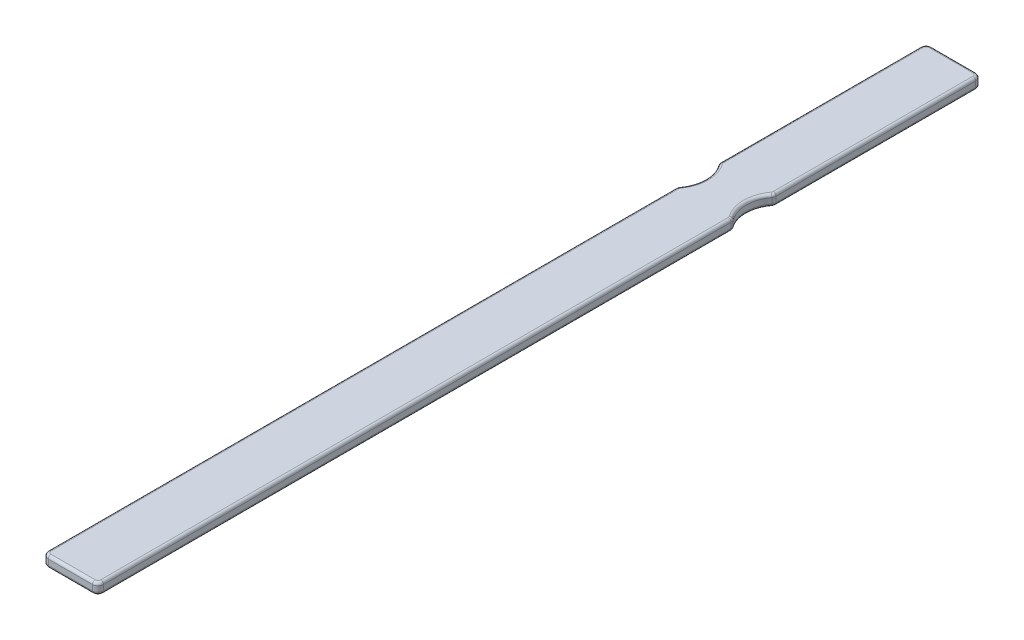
from build123d import *

# Parameters (mm, degrees)
BOSS_EXTRUDE1_DEPTH = 4
FILLET1_R           = 2
FILLET2_R           = 1


with BuildPart() as part:
    # Sketch1 → Boss-Extrude1 (new body)
    with BuildSketch(Plane(origin=(0, 0, 0), x_dir=(1, 0, 0), z_dir=(0, 1, 0))):
        with BuildLine():
            Line((-10, 0), (10, 0))
            Line((10, 0), (10, 230))
            ThreePointArc((10, 230), (7.367496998, 237.5), (10, 245))
            Line((10, 245), (10, 320))
            Line((10, 320), (-10, 320))
            Line((-10, 320), (-10, 245))
            ThreePointArc((-10, 245), (-7.367496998, 237.5), (-10, 230))
            Line((-10, 230), (-10, 0))
        make_face()
    extrude(amount=BOSS_EXTRUDE1_DEPTH)

    # Fillet1
    fillet1_edges = [part.edges().sort_by_distance(p)[0] for p in [
        (-10, 2, -230),
        (-10, 2, -245),
        (-10, 2, -320),
        (10, 2, -320),
        (10, 2, -245),
        (10, 2, -230),
        (10, 2, 0),
        (-10, 2, 0),
    ]]
    fillet(fillet1_edges, radius=FILLET1_R)

    # Fillet2
    fillet2_edges = [part.edges().sort_by_distance(p)[0] for p in [
        (10, 0, -281.835951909),
        (10, 4, -281.835951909),
        (-10, 0, -115.664048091),
        (-7.367496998, 0, -237.5),
        (-10, 0, -281.835951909),
        (0, 0, -320),
        (7.367496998, 0, -237.5),
        (10, 0, -115.664048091),
        (0, 0, 0),
        (-9.414213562, 0, -319.414213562),
        (9.414213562, 0, -319.414213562),
        (9.414213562, 0, -0.585786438),
        (-9.414213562, 0, -0.585786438),
        (-9.903661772, 0, -245.058656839),
        (-9.903661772, 0, -229.941343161),
        (9.903661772, 0, -229.941343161),
        (9.903661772, 0, -245.058656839),
        (7.367496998, 4, -237.5),
        (-10, 4, -115.664048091),
        (0, 4, 0),
        (10, 4, -115.664048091),
        (0, 4, -320),
        (-10, 4, -281.835951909),
        (-7.367496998, 4, -237.5),
        (-9.414213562, 4, -319.414213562),
        (9.414213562, 4, -319.414213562),
        (9.414213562, 4, -0.585786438),
        (-9.414213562, 4, -0.585786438),
        (-9.903661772, 4, -245.058656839),
        (-9.903661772, 4, -229.941343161),
        (9.903661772, 4, -229.941343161),
        (9.903661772, 4, -245.058656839),
    ]]
    fillet(fillet2_edges, radius=FILLET2_R)


solid = part.part
